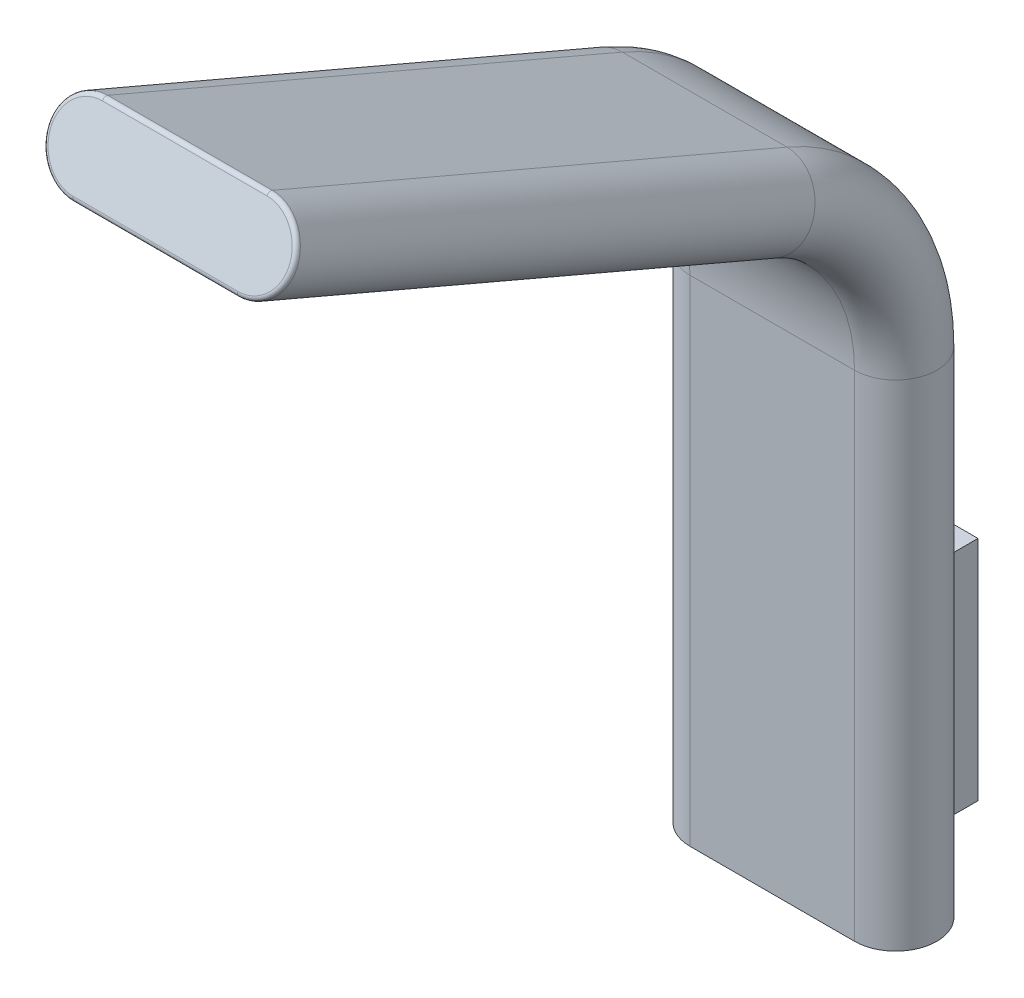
ISO-10303-21;
HEADER;
FILE_DESCRIPTION(('STEP AP214'),'2;1');
FILE_NAME('part.step','',(''),(''),'','','');
FILE_SCHEMA(('AUTOMOTIVE_DESIGN { 1 0 10303 214 1 1 1 1 }'));
ENDSEC;
DATA;
#1=APPLICATION_CONTEXT('core data for automotive mechanical design processes');
#2=APPLICATION_PROTOCOL_DEFINITION('international standard','automotive_design',2000,#1);
#3=PRODUCT_CONTEXT('',#1,'mechanical');
#4=PRODUCT('Part','Part','',(#3));
#5=PRODUCT_RELATED_PRODUCT_CATEGORY('part','',(#4));
#6=PRODUCT_DEFINITION_FORMATION('','',#4);
#7=PRODUCT_DEFINITION_CONTEXT('part definition',#1,'design');
#8=PRODUCT_DEFINITION('design','',#6,#7);
#9=PRODUCT_DEFINITION_SHAPE('','',#8);
#10=(LENGTH_UNIT() NAMED_UNIT(*) SI_UNIT(.MILLI.,.METRE.));
#11=(NAMED_UNIT(*) PLANE_ANGLE_UNIT() SI_UNIT($,.RADIAN.));
#12=(NAMED_UNIT(*) SI_UNIT($,.STERADIAN.) SOLID_ANGLE_UNIT());
#13=UNCERTAINTY_MEASURE_WITH_UNIT(LENGTH_MEASURE(1.E-05),#10,'distance_accuracy_value','');
#14=(GEOMETRIC_REPRESENTATION_CONTEXT(3) GLOBAL_UNCERTAINTY_ASSIGNED_CONTEXT((#13)) GLOBAL_UNIT_ASSIGNED_CONTEXT((#10,
#11,#12)) REPRESENTATION_CONTEXT('',''));
#15=CARTESIAN_POINT('',(0.,0.,0.));
#16=DIRECTION('',(0.,0.,1.));
#17=DIRECTION('',(1.,0.,0.));
#18=AXIS2_PLACEMENT_3D('',#15,#16,#17);
#19=CARTESIAN_POINT('',(-20.,0.,-10.));
#20=DIRECTION('',(0.,0.,-1.));
#21=DIRECTION('',(-1.,0.,0.));
#22=AXIS2_PLACEMENT_3D('',#19,#20,#21);
#23=PLANE('',#22);
#24=DIRECTION('',(0.,1.,0.));
#25=VECTOR('',#24,1.);
#26=CARTESIAN_POINT('',(20.,0.,-10.));
#27=LINE('',#26,#25);
#28=CARTESIAN_POINT('',(20.,69.7986493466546,-10.));
#29=VERTEX_POINT('',#28);
#30=CARTESIAN_POINT('',(20.,120.193335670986,-10.));
#31=VERTEX_POINT('',#30);
#32=EDGE_CURVE('E258',#29,#31,#27,.T.);
#33=ORIENTED_EDGE('',*,*,#32,.F.);
#34=DIRECTION('',(1.,0.,0.));
#35=VECTOR('',#34,1.);
#36=CARTESIAN_POINT('',(20.,69.7986493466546,-10.));
#37=LINE('',#36,#35);
#38=CARTESIAN_POINT('',(-20.,69.7986493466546,-10.));
#39=VERTEX_POINT('',#38);
#40=EDGE_CURVE('E217',#39,#29,#37,.T.);
#41=ORIENTED_EDGE('',*,*,#40,.F.);
#42=DIRECTION('',(0.,1.,0.));
#43=VECTOR('',#42,1.);
#44=CARTESIAN_POINT('',(-20.,0.,-10.));
#45=LINE('',#44,#43);
#46=CARTESIAN_POINT('',(-20.,120.193335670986,-10.));
#47=VERTEX_POINT('',#46);
#48=EDGE_CURVE('E248',#39,#47,#45,.T.);
#49=ORIENTED_EDGE('',*,*,#48,.T.);
#50=DIRECTION('',(-1.,0.,0.));
#51=VECTOR('',#50,1.);
#52=CARTESIAN_POINT('',(-20.,120.193335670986,-10.));
#53=LINE('',#52,#51);
#54=EDGE_CURVE('E244',#31,#47,#53,.T.);
#55=ORIENTED_EDGE('',*,*,#54,.F.);
#56=EDGE_LOOP('',(#33,#41,#49,#55));
#57=FACE_BOUND('',#56,.T.);
#58=ADVANCED_FACE('F39',(#57),#23,.T.);
#59=CARTESIAN_POINT('',(-20.,0.,-10.));
#60=VERTEX_POINT('',#59);
#61=CARTESIAN_POINT('',(-20.,14.5866743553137,-10.));
#62=VERTEX_POINT('',#61);
#63=EDGE_CURVE('E250',#60,#62,#45,.T.);
#64=ORIENTED_EDGE('',*,*,#63,.T.);
#65=DIRECTION('',(-1.,0.,0.));
#66=VECTOR('',#65,1.);
#67=CARTESIAN_POINT('',(20.,14.5866743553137,-10.));
#68=LINE('',#67,#66);
#69=CARTESIAN_POINT('',(20.,14.5866743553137,-10.));
#70=VERTEX_POINT('',#69);
#71=EDGE_CURVE('E204',#70,#62,#68,.T.);
#72=ORIENTED_EDGE('',*,*,#71,.F.);
#73=CARTESIAN_POINT('',(20.,0.,-10.));
#74=VERTEX_POINT('',#73);
#75=EDGE_CURVE('E249',#74,#70,#27,.T.);
#76=ORIENTED_EDGE('',*,*,#75,.F.);
#77=DIRECTION('',(-1.,0.,0.));
#78=VECTOR('',#77,1.);
#79=CARTESIAN_POINT('',(-20.,0.,-10.));
#80=LINE('',#79,#78);
#81=EDGE_CURVE('E239',#74,#60,#80,.T.);
#82=ORIENTED_EDGE('',*,*,#81,.T.);
#83=EDGE_LOOP('',(#64,#72,#76,#82));
#84=FACE_BOUND('',#83,.T.);
#85=ADVANCED_FACE('F397',(#84),#23,.T.);
#86=CARTESIAN_POINT('',(-20.,0.,0.));
#87=DIRECTION('',(0.,1.,0.));
#88=DIRECTION('',(0.,0.,1.));
#89=AXIS2_PLACEMENT_3D('',#86,#87,#88);
#90=PLANE('',#89);
#91=CARTESIAN_POINT('',(-20.,0.,0.));
#92=DIRECTION('',(0.,1.,0.));
#93=DIRECTION('',(0.,0.,1.));
#94=AXIS2_PLACEMENT_3D('',#91,#92,#93);
#95=CIRCLE('',#94,10.);
#96=CARTESIAN_POINT('',(-20.,0.,10.));
#97=VERTEX_POINT('',#96);
#98=EDGE_CURVE('E243',#60,#97,#95,.T.);
#99=ORIENTED_EDGE('',*,*,#98,.F.);
#100=ORIENTED_EDGE('',*,*,#81,.F.);
#101=CARTESIAN_POINT('',(20.,0.,0.));
#102=DIRECTION('',(0.,1.,0.));
#103=DIRECTION('',(0.,0.,-1.));
#104=AXIS2_PLACEMENT_3D('',#101,#102,#103);
#105=CIRCLE('',#104,9.99999999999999);
#106=CARTESIAN_POINT('',(20.,0.,9.99999999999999));
#107=VERTEX_POINT('',#106);
#108=EDGE_CURVE('E310',#107,#74,#105,.T.);
#109=ORIENTED_EDGE('',*,*,#108,.F.);
#110=DIRECTION('',(1.,0.,0.));
#111=VECTOR('',#110,1.);
#112=CARTESIAN_POINT('',(-20.,0.,10.));
#113=LINE('',#112,#111);
#114=EDGE_CURVE('E286',#97,#107,#113,.T.);
#115=ORIENTED_EDGE('',*,*,#114,.F.);
#116=EDGE_LOOP('',(#99,#100,#109,#115));
#117=FACE_BOUND('',#116,.T.);
#118=ADVANCED_FACE('F403',(#117),#90,.F.);
#119=CARTESIAN_POINT('',(-20.,220.,156.32654574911));
#120=DIRECTION('',(0.,0.392931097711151,0.919567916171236));
#121=DIRECTION('',(0.,-0.919567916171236,0.392931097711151));
#122=AXIS2_PLACEMENT_3D('',#119,#120,#121);
#123=PLANE('',#122);
#124=CARTESIAN_POINT('',(20.,220.,156.32654574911));
#125=DIRECTION('',(0.,0.392931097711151,0.919567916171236));
#126=DIRECTION('',(0.,-0.919567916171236,0.392931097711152));
#127=AXIS2_PLACEMENT_3D('',#124,#125,#126);
#128=CIRCLE('',#127,8.99999999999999);
#129=CARTESIAN_POINT('',(20.,211.723888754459,159.86292562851));
#130=VERTEX_POINT('',#129);
#131=CARTESIAN_POINT('',(20.,228.276111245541,152.79016586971));
#132=VERTEX_POINT('',#131);
#133=EDGE_CURVE('E343',#130,#132,#128,.T.);
#134=ORIENTED_EDGE('',*,*,#133,.T.);
#135=DIRECTION('',(-1.,0.,0.));
#136=VECTOR('',#135,1.);
#137=CARTESIAN_POINT('',(-20.,228.276111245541,152.79016586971));
#138=LINE('',#137,#136);
#139=CARTESIAN_POINT('',(-20.,228.276111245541,152.79016586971));
#140=VERTEX_POINT('',#139);
#141=EDGE_CURVE('E346',#132,#140,#138,.T.);
#142=ORIENTED_EDGE('',*,*,#141,.T.);
#143=CARTESIAN_POINT('',(-20.,220.,156.32654574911));
#144=DIRECTION('',(0.,0.392931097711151,0.919567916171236));
#145=DIRECTION('',(0.,-0.919567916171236,0.392931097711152));
#146=AXIS2_PLACEMENT_3D('',#143,#144,#145);
#147=CIRCLE('',#146,9.);
#148=CARTESIAN_POINT('',(-20.,211.723888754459,159.86292562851));
#149=VERTEX_POINT('',#148);
#150=EDGE_CURVE('E328',#140,#149,#147,.T.);
#151=ORIENTED_EDGE('',*,*,#150,.T.);
#152=DIRECTION('',(1.,0.,0.));
#153=VECTOR('',#152,1.);
#154=CARTESIAN_POINT('',(-20.,211.723888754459,159.86292562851));
#155=LINE('',#154,#153);
#156=EDGE_CURVE('E340',#149,#130,#155,.T.);
#157=ORIENTED_EDGE('',*,*,#156,.T.);
#158=EDGE_LOOP('',(#134,#142,#151,#157));
#159=FACE_BOUND('',#158,.T.);
#160=ADVANCED_FACE('F427',(#159),#123,.T.);
#161=CARTESIAN_POINT('',(-20.,0.,0.));
#162=DIRECTION('',(0.,1.,0.));
#163=DIRECTION('',(0.,0.,1.));
#164=AXIS2_PLACEMENT_3D('',#161,#162,#163);
#165=CYLINDRICAL_SURFACE('',#164,10.);
#166=DIRECTION('',(0.,1.,0.));
#167=VECTOR('',#166,1.);
#168=CARTESIAN_POINT('',(-20.,0.,10.));
#169=LINE('',#168,#167);
#170=CARTESIAN_POINT('',(-20.,120.193335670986,10.));
#171=VERTEX_POINT('',#170);
#172=EDGE_CURVE('E290',#97,#171,#169,.T.);
#173=ORIENTED_EDGE('',*,*,#172,.T.);
#174=CARTESIAN_POINT('',(-20.,120.193335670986,0.));
#175=DIRECTION('',(0.,1.,0.));
#176=DIRECTION('',(0.,0.,1.));
#177=AXIS2_PLACEMENT_3D('',#174,#175,#176);
#178=CIRCLE('',#177,10.);
#179=EDGE_CURVE('E254',#47,#171,#178,.T.);
#180=ORIENTED_EDGE('',*,*,#179,.F.);
#181=ORIENTED_EDGE('',*,*,#48,.F.);
#182=DIRECTION('',(0.,1.,0.));
#183=VECTOR('',#182,1.);
#184=CARTESIAN_POINT('',(-20.,14.5866743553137,-10.));
#185=LINE('',#184,#183);
#186=EDGE_CURVE('E198',#62,#39,#185,.T.);
#187=ORIENTED_EDGE('',*,*,#186,.F.);
#188=ORIENTED_EDGE('',*,*,#63,.F.);
#189=ORIENTED_EDGE('',*,*,#98,.T.);
#190=EDGE_LOOP('',(#173,#180,#181,#187,#188,#189));
#191=FACE_BOUND('',#190,.T.);
#192=ADVANCED_FACE('F423',(#191),#165,.T.);
#193=CARTESIAN_POINT('',(-20.,0.,10.));
#194=DIRECTION('',(0.,0.,1.));
#195=DIRECTION('',(1.,0.,0.));
#196=AXIS2_PLACEMENT_3D('',#193,#194,#195);
#197=PLANE('',#196);
#198=DIRECTION('',(0.,1.,0.));
#199=VECTOR('',#198,1.);
#200=CARTESIAN_POINT('',(20.,0.,9.99999999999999));
#201=LINE('',#200,#199);
#202=CARTESIAN_POINT('',(20.,120.193335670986,9.99999999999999));
#203=VERTEX_POINT('',#202);
#204=EDGE_CURVE('E314',#107,#203,#201,.T.);
#205=ORIENTED_EDGE('',*,*,#204,.T.);
#206=DIRECTION('',(1.,0.,0.));
#207=VECTOR('',#206,1.);
#208=CARTESIAN_POINT('',(-20.,120.193335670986,10.));
#209=LINE('',#208,#207);
#210=EDGE_CURVE('E294',#171,#203,#209,.T.);
#211=ORIENTED_EDGE('',*,*,#210,.F.);
#212=ORIENTED_EDGE('',*,*,#172,.F.);
#213=ORIENTED_EDGE('',*,*,#114,.T.);
#214=EDGE_LOOP('',(#205,#211,#212,#213));
#215=FACE_BOUND('',#214,.T.);
#216=ADVANCED_FACE('F426',(#215),#197,.T.);
#217=CARTESIAN_POINT('',(20.,0.,0.));
#218=DIRECTION('',(0.,1.,0.));
#219=DIRECTION('',(0.,0.,1.));
#220=AXIS2_PLACEMENT_3D('',#217,#218,#219);
#221=CYLINDRICAL_SURFACE('',#220,9.99999999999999);
#222=CARTESIAN_POINT('',(20.,120.193335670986,0.));
#223=DIRECTION('',(0.,1.,0.));
#224=DIRECTION('',(0.,0.,-1.));
#225=AXIS2_PLACEMENT_3D('',#222,#223,#224);
#226=CIRCLE('',#225,9.99999999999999);
#227=EDGE_CURVE('E272',#203,#31,#226,.T.);
#228=ORIENTED_EDGE('',*,*,#227,.F.);
#229=ORIENTED_EDGE('',*,*,#204,.F.);
#230=ORIENTED_EDGE('',*,*,#108,.T.);
#231=ORIENTED_EDGE('',*,*,#75,.T.);
#232=DIRECTION('',(0.,-1.,0.));
#233=VECTOR('',#232,1.);
#234=CARTESIAN_POINT('',(20.,14.5866743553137,-10.));
#235=LINE('',#234,#233);
#236=EDGE_CURVE('E221',#29,#70,#235,.T.);
#237=ORIENTED_EDGE('',*,*,#236,.F.);
#238=ORIENTED_EDGE('',*,*,#32,.T.);
#239=EDGE_LOOP('',(#228,#229,#230,#231,#237,#238));
#240=FACE_BOUND('',#239,.T.);
#241=ADVANCED_FACE('F415',(#240),#221,.T.);
#242=CARTESIAN_POINT('',(0.,120.193335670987,50.));
#243=DIRECTION('',(1.,0.,0.));
#244=DIRECTION('',(0.,0.,-1.));
#245=AXIS2_PLACEMENT_3D('',#242,#243,#244);
#246=CYLINDRICAL_SURFACE('',#245,60.);
#247=CARTESIAN_POINT('',(-20.,120.193335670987,50.));
#248=DIRECTION('',(1.,0.,0.));
#249=DIRECTION('',(0.,0.,-1.));
#250=AXIS2_PLACEMENT_3D('',#247,#248,#249);
#251=CIRCLE('',#250,60.);
#252=CARTESIAN_POINT('',(-20.,175.367410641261,26.4241341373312));
#253=VERTEX_POINT('',#252);
#254=EDGE_CURVE('E263',#47,#253,#251,.T.);
#255=ORIENTED_EDGE('',*,*,#254,.T.);
#256=DIRECTION('',(-1.,0.,0.));
#257=VECTOR('',#256,1.);
#258=CARTESIAN_POINT('',(-20.,175.367410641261,26.4241341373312));
#259=LINE('',#258,#257);
#260=CARTESIAN_POINT('',(20.,175.367410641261,26.4241341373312));
#261=VERTEX_POINT('',#260);
#262=EDGE_CURVE('E259',#261,#253,#259,.T.);
#263=ORIENTED_EDGE('',*,*,#262,.F.);
#264=CARTESIAN_POINT('',(20.,120.193335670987,50.));
#265=DIRECTION('',(1.,0.,0.));
#266=DIRECTION('',(0.,0.,-1.));
#267=AXIS2_PLACEMENT_3D('',#264,#265,#266);
#268=CIRCLE('',#267,60.);
#269=EDGE_CURVE('E264',#31,#261,#268,.T.);
#270=ORIENTED_EDGE('',*,*,#269,.F.);
#271=ORIENTED_EDGE('',*,*,#54,.T.);
#272=EDGE_LOOP('',(#255,#263,#270,#271));
#273=FACE_BOUND('',#272,.T.);
#274=ADVANCED_FACE('F411',(#273),#246,.T.);
#275=CARTESIAN_POINT('',(-20.,120.193335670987,50.));
#276=DIRECTION('',(1.,0.,0.));
#277=DIRECTION('',(0.,0.,-1.));
#278=AXIS2_PLACEMENT_3D('',#275,#276,#277);
#279=TOROIDAL_SURFACE('',#278,50.,10.);
#280=CARTESIAN_POINT('',(-20.,120.193335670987,50.));
#281=DIRECTION('',(1.,0.,0.));
#282=DIRECTION('',(0.,0.,-1.));
#283=AXIS2_PLACEMENT_3D('',#280,#281,#282);
#284=CIRCLE('',#283,40.);
#285=CARTESIAN_POINT('',(-20.,156.976052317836,34.2827560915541));
#286=VERTEX_POINT('',#285);
#287=EDGE_CURVE('E298',#171,#286,#284,.T.);
#288=ORIENTED_EDGE('',*,*,#287,.T.);
#289=CARTESIAN_POINT('',(-20.,166.171731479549,30.3534451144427));
#290=DIRECTION('',(0.,0.392931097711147,0.919567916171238));
#291=DIRECTION('',(0.,-0.919567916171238,0.392931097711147));
#292=AXIS2_PLACEMENT_3D('',#289,#290,#291);
#293=CIRCLE('',#292,10.);
#294=EDGE_CURVE('E268',#253,#286,#293,.T.);
#295=ORIENTED_EDGE('',*,*,#294,.F.);
#296=ORIENTED_EDGE('',*,*,#254,.F.);
#297=ORIENTED_EDGE('',*,*,#179,.T.);
#298=EDGE_LOOP('',(#288,#295,#296,#297));
#299=FACE_BOUND('',#298,.T.);
#300=ADVANCED_FACE('F414',(#299),#279,.T.);
#301=CARTESIAN_POINT('',(0.,120.193335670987,50.));
#302=DIRECTION('',(1.,0.,0.));
#303=DIRECTION('',(0.,0.,-1.));
#304=AXIS2_PLACEMENT_3D('',#301,#302,#303);
#305=CYLINDRICAL_SURFACE('',#304,40.);
#306=CARTESIAN_POINT('',(20.,120.193335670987,50.));
#307=DIRECTION('',(1.,0.,0.));
#308=DIRECTION('',(0.,0.,-1.));
#309=AXIS2_PLACEMENT_3D('',#306,#307,#308);
#310=CIRCLE('',#309,40.);
#311=CARTESIAN_POINT('',(20.,156.976052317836,34.2827560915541));
#312=VERTEX_POINT('',#311);
#313=EDGE_CURVE('E321',#203,#312,#310,.T.);
#314=ORIENTED_EDGE('',*,*,#313,.T.);
#315=DIRECTION('',(1.,0.,0.));
#316=VECTOR('',#315,1.);
#317=CARTESIAN_POINT('',(-20.,156.976052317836,34.2827560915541));
#318=LINE('',#317,#316);
#319=EDGE_CURVE('E302',#286,#312,#318,.T.);
#320=ORIENTED_EDGE('',*,*,#319,.F.);
#321=ORIENTED_EDGE('',*,*,#287,.F.);
#322=ORIENTED_EDGE('',*,*,#210,.T.);
#323=EDGE_LOOP('',(#314,#320,#321,#322));
#324=FACE_BOUND('',#323,.T.);
#325=ADVANCED_FACE('F431',(#324),#305,.F.);
#326=CARTESIAN_POINT('',(20.,120.193335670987,50.));
#327=DIRECTION('',(1.,0.,0.));
#328=DIRECTION('',(0.,0.,-1.));
#329=AXIS2_PLACEMENT_3D('',#326,#327,#328);
#330=TOROIDAL_SURFACE('',#329,50.,9.99999999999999);
#331=CARTESIAN_POINT('',(20.,166.171731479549,30.3534451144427));
#332=DIRECTION('',(0.,0.392931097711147,0.919567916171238));
#333=DIRECTION('',(0.,0.919567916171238,-0.392931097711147));
#334=AXIS2_PLACEMENT_3D('',#331,#332,#333);
#335=CIRCLE('',#334,9.99999999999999);
#336=EDGE_CURVE('E282',#312,#261,#335,.T.);
#337=ORIENTED_EDGE('',*,*,#336,.F.);
#338=ORIENTED_EDGE('',*,*,#313,.F.);
#339=ORIENTED_EDGE('',*,*,#227,.T.);
#340=ORIENTED_EDGE('',*,*,#269,.T.);
#341=EDGE_LOOP('',(#337,#338,#339,#340));
#342=FACE_BOUND('',#341,.T.);
#343=ADVANCED_FACE('F421',(#342),#330,.T.);
#344=CARTESIAN_POINT('',(-20.,175.367410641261,26.4241341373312));
#345=DIRECTION('',(0.,0.919567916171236,-0.392931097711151));
#346=DIRECTION('',(0.,0.392931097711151,0.919567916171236));
#347=AXIS2_PLACEMENT_3D('',#344,#345,#346);
#348=PLANE('',#347);
#349=DIRECTION('',(0.,0.392931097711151,0.919567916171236));
#350=VECTOR('',#349,1.);
#351=CARTESIAN_POINT('',(-20.,175.367410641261,26.4241341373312));
#352=LINE('',#351,#350);
#353=CARTESIAN_POINT('',(-20.,228.802748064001,151.477666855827));
#354=VERTEX_POINT('',#353);
#355=EDGE_CURVE('E273',#253,#354,#352,.T.);
#356=ORIENTED_EDGE('',*,*,#355,.T.);
#357=DIRECTION('',(-1.,0.,0.));
#358=VECTOR('',#357,1.);
#359=CARTESIAN_POINT('',(-20.,228.802748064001,151.477666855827));
#360=LINE('',#359,#358);
#361=CARTESIAN_POINT('',(20.,228.802748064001,151.477666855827));
#362=VERTEX_POINT('',#361);
#363=EDGE_CURVE('E350',#354,#362,#360,.F.);
#364=ORIENTED_EDGE('',*,*,#363,.T.);
#365=DIRECTION('',(0.,0.392931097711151,0.919567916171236));
#366=VECTOR('',#365,1.);
#367=CARTESIAN_POINT('',(20.,175.367410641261,26.4241341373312));
#368=LINE('',#367,#366);
#369=EDGE_CURVE('E278',#261,#362,#368,.T.);
#370=ORIENTED_EDGE('',*,*,#369,.F.);
#371=ORIENTED_EDGE('',*,*,#262,.T.);
#372=EDGE_LOOP('',(#356,#364,#370,#371));
#373=FACE_BOUND('',#372,.T.);
#374=ADVANCED_FACE('F417',(#373),#348,.T.);
#375=CARTESIAN_POINT('',(-20.,166.171731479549,30.3534451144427));
#376=DIRECTION('',(0.,0.392931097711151,0.919567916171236));
#377=DIRECTION('',(0.,-0.919567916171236,0.392931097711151));
#378=AXIS2_PLACEMENT_3D('',#375,#376,#377);
#379=CYLINDRICAL_SURFACE('',#378,10.);
#380=DIRECTION('',(0.,0.392931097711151,0.919567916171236));
#381=VECTOR('',#380,1.);
#382=CARTESIAN_POINT('',(-20.,156.976052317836,34.2827560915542));
#383=LINE('',#382,#381);
#384=CARTESIAN_POINT('',(-20.,210.411389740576,159.33628881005));
#385=VERTEX_POINT('',#384);
#386=EDGE_CURVE('E277',#286,#385,#383,.T.);
#387=ORIENTED_EDGE('',*,*,#386,.T.);
#388=CARTESIAN_POINT('',(-20.,219.607068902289,155.406977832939));
#389=DIRECTION('',(0.,0.392931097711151,0.919567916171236));
#390=DIRECTION('',(0.,-0.919567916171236,0.392931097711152));
#391=AXIS2_PLACEMENT_3D('',#388,#389,#390);
#392=CIRCLE('',#391,10.);
#393=EDGE_CURVE('E360',#385,#354,#392,.F.);
#394=ORIENTED_EDGE('',*,*,#393,.T.);
#395=ORIENTED_EDGE('',*,*,#355,.F.);
#396=ORIENTED_EDGE('',*,*,#294,.T.);
#397=EDGE_LOOP('',(#387,#394,#395,#396));
#398=FACE_BOUND('',#397,.T.);
#399=ADVANCED_FACE('F420',(#398),#379,.T.);
#400=CARTESIAN_POINT('',(-20.,156.976052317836,34.2827560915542));
#401=DIRECTION('',(0.,-0.919567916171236,0.392931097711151));
#402=DIRECTION('',(0.,-0.392931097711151,-0.919567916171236));
#403=AXIS2_PLACEMENT_3D('',#400,#401,#402);
#404=PLANE('',#403);
#405=CARTESIAN_POINT('',(0.,197.642774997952,129.454183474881));
#406=DIRECTION('',(0.,-0.919567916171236,0.392931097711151));
#407=DIRECTION('',(0.,-0.392931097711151,-0.919567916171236));
#408=AXIS2_PLACEMENT_3D('',#405,#406,#407);
#409=CIRCLE('',#408,11.);
#410=CARTESIAN_POINT('',(-11.0000000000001,197.642774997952,129.454183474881));
#411=VERTEX_POINT('',#410);
#412=CARTESIAN_POINT('',(11.,197.642774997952,129.454183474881));
#413=VERTEX_POINT('',#412);
#414=EDGE_CURVE('E49',#411,#413,#409,.F.);
#415=ORIENTED_EDGE('',*,*,#414,.T.);
#416=DIRECTION('',(0.,0.392931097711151,0.919567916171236));
#417=VECTOR('',#416,1.);
#418=CARTESIAN_POINT('',(11.,168.172942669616,60.4865897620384));
#419=LINE('',#418,#417);
#420=CARTESIAN_POINT('',(11.,168.172942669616,60.4865897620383));
#421=VERTEX_POINT('',#420);
#422=EDGE_CURVE('E11',#413,#421,#419,.F.);
#423=ORIENTED_EDGE('',*,*,#422,.T.);
#424=CARTESIAN_POINT('',(0.,168.172942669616,60.4865897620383));
#425=DIRECTION('',(0.,-0.919567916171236,0.392931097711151));
#426=DIRECTION('',(0.,-0.392931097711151,-0.919567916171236));
#427=AXIS2_PLACEMENT_3D('',#424,#425,#426);
#428=CIRCLE('',#427,11.);
#429=CARTESIAN_POINT('',(-11.0000000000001,168.172942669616,60.4865897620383));
#430=VERTEX_POINT('',#429);
#431=EDGE_CURVE('E181',#421,#430,#428,.F.);
#432=ORIENTED_EDGE('',*,*,#431,.T.);
#433=DIRECTION('',(0.,-0.392931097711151,-0.919567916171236));
#434=VECTOR('',#433,1.);
#435=CARTESIAN_POINT('',(-11.0000000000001,197.642774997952,129.454183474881));
#436=LINE('',#435,#434);
#437=EDGE_CURVE('E60',#430,#411,#436,.F.);
#438=ORIENTED_EDGE('',*,*,#437,.T.);
#439=EDGE_LOOP('',(#415,#423,#432,#438));
#440=FACE_BOUND('',#439,.T.);
#441=DIRECTION('',(0.,0.392931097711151,0.919567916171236));
#442=VECTOR('',#441,1.);
#443=CARTESIAN_POINT('',(20.,156.976052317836,34.2827560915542));
#444=LINE('',#443,#442);
#445=CARTESIAN_POINT('',(20.,210.411389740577,159.33628881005));
#446=VERTEX_POINT('',#445);
#447=EDGE_CURVE('E306',#312,#446,#444,.T.);
#448=ORIENTED_EDGE('',*,*,#447,.T.);
#449=DIRECTION('',(1.,0.,0.));
#450=VECTOR('',#449,1.);
#451=CARTESIAN_POINT('',(-20.,210.411389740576,159.33628881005));
#452=LINE('',#451,#450);
#453=EDGE_CURVE('E357',#446,#385,#452,.F.);
#454=ORIENTED_EDGE('',*,*,#453,.T.);
#455=ORIENTED_EDGE('',*,*,#386,.F.);
#456=ORIENTED_EDGE('',*,*,#319,.T.);
#457=EDGE_LOOP('',(#448,#454,#455,#456));
#458=FACE_BOUND('',#457,.T.);
#459=ADVANCED_FACE('F435',(#440,#458),#404,.T.);
#460=CARTESIAN_POINT('',(20.,166.171731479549,30.3534451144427));
#461=DIRECTION('',(0.,0.392931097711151,0.919567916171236));
#462=DIRECTION('',(0.,-0.919567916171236,0.392931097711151));
#463=AXIS2_PLACEMENT_3D('',#460,#461,#462);
#464=CYLINDRICAL_SURFACE('',#463,9.99999999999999);
#465=ORIENTED_EDGE('',*,*,#369,.T.);
#466=CARTESIAN_POINT('',(20.,219.607068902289,155.406977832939));
#467=DIRECTION('',(0.,0.392931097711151,0.919567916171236));
#468=DIRECTION('',(0.,-0.919567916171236,0.392931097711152));
#469=AXIS2_PLACEMENT_3D('',#466,#467,#468);
#470=CIRCLE('',#469,9.99999999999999);
#471=EDGE_CURVE('E354',#362,#446,#470,.F.);
#472=ORIENTED_EDGE('',*,*,#471,.T.);
#473=ORIENTED_EDGE('',*,*,#447,.F.);
#474=ORIENTED_EDGE('',*,*,#336,.T.);
#475=EDGE_LOOP('',(#465,#472,#473,#474));
#476=FACE_BOUND('',#475,.T.);
#477=ADVANCED_FACE('F405',(#476),#464,.T.);
#478=CARTESIAN_POINT('',(-20.,14.5866743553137,-20.));
#479=DIRECTION('',(1.,0.,0.));
#480=DIRECTION('',(0.,0.,-1.));
#481=AXIS2_PLACEMENT_3D('',#478,#479,#480);
#482=PLANE('',#481);
#483=ORIENTED_EDGE('',*,*,#186,.T.);
#484=DIRECTION('',(0.,0.,1.));
#485=VECTOR('',#484,1.);
#486=CARTESIAN_POINT('',(-20.,69.7986493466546,-20.));
#487=LINE('',#486,#485);
#488=CARTESIAN_POINT('',(-20.,69.7986493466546,-20.));
#489=VERTEX_POINT('',#488);
#490=EDGE_CURVE('E236',#489,#39,#487,.T.);
#491=ORIENTED_EDGE('',*,*,#490,.F.);
#492=DIRECTION('',(0.,1.,0.));
#493=VECTOR('',#492,1.);
#494=CARTESIAN_POINT('',(-20.,14.5866743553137,-20.));
#495=LINE('',#494,#493);
#496=CARTESIAN_POINT('',(-20.,14.5866743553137,-20.));
#497=VERTEX_POINT('',#496);
#498=EDGE_CURVE('E199',#497,#489,#495,.T.);
#499=ORIENTED_EDGE('',*,*,#498,.F.);
#500=DIRECTION('',(0.,0.,1.));
#501=VECTOR('',#500,1.);
#502=CARTESIAN_POINT('',(-20.,14.5866743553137,-20.));
#503=LINE('',#502,#501);
#504=EDGE_CURVE('E213',#497,#62,#503,.T.);
#505=ORIENTED_EDGE('',*,*,#504,.T.);
#506=EDGE_LOOP('',(#483,#491,#499,#505));
#507=FACE_BOUND('',#506,.T.);
#508=ADVANCED_FACE('F409',(#507),#482,.F.);
#509=CARTESIAN_POINT('',(20.,69.7986493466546,-20.));
#510=DIRECTION('',(0.,-1.,0.));
#511=DIRECTION('',(0.,0.,-1.));
#512=AXIS2_PLACEMENT_3D('',#509,#510,#511);
#513=PLANE('',#512);
#514=ORIENTED_EDGE('',*,*,#40,.T.);
#515=DIRECTION('',(0.,0.,1.));
#516=VECTOR('',#515,1.);
#517=CARTESIAN_POINT('',(20.,69.7986493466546,-20.));
#518=LINE('',#517,#516);
#519=CARTESIAN_POINT('',(20.,69.7986493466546,-20.));
#520=VERTEX_POINT('',#519);
#521=EDGE_CURVE('E233',#520,#29,#518,.T.);
#522=ORIENTED_EDGE('',*,*,#521,.F.);
#523=DIRECTION('',(1.,0.,0.));
#524=VECTOR('',#523,1.);
#525=CARTESIAN_POINT('',(20.,69.7986493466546,-20.));
#526=LINE('',#525,#524);
#527=EDGE_CURVE('E203',#489,#520,#526,.T.);
#528=ORIENTED_EDGE('',*,*,#527,.F.);
#529=ORIENTED_EDGE('',*,*,#490,.T.);
#530=EDGE_LOOP('',(#514,#522,#528,#529));
#531=FACE_BOUND('',#530,.T.);
#532=ADVANCED_FACE('F528',(#531),#513,.F.);
#533=CARTESIAN_POINT('',(20.,14.5866743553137,-20.));
#534=DIRECTION('',(-1.,0.,0.));
#535=DIRECTION('',(0.,0.,1.));
#536=AXIS2_PLACEMENT_3D('',#533,#534,#535);
#537=PLANE('',#536);
#538=ORIENTED_EDGE('',*,*,#236,.T.);
#539=DIRECTION('',(0.,0.,1.));
#540=VECTOR('',#539,1.);
#541=CARTESIAN_POINT('',(20.,14.5866743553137,-20.));
#542=LINE('',#541,#540);
#543=CARTESIAN_POINT('',(20.,14.5866743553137,-20.));
#544=VERTEX_POINT('',#543);
#545=EDGE_CURVE('E229',#544,#70,#542,.T.);
#546=ORIENTED_EDGE('',*,*,#545,.F.);
#547=DIRECTION('',(0.,-1.,0.));
#548=VECTOR('',#547,1.);
#549=CARTESIAN_POINT('',(20.,14.5866743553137,-20.));
#550=LINE('',#549,#548);
#551=EDGE_CURVE('E207',#520,#544,#550,.T.);
#552=ORIENTED_EDGE('',*,*,#551,.F.);
#553=ORIENTED_EDGE('',*,*,#521,.T.);
#554=EDGE_LOOP('',(#538,#546,#552,#553));
#555=FACE_BOUND('',#554,.T.);
#556=ADVANCED_FACE('F514',(#555),#537,.F.);
#557=CARTESIAN_POINT('',(20.,14.5866743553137,-20.));
#558=DIRECTION('',(0.,1.,0.));
#559=DIRECTION('',(0.,0.,1.));
#560=AXIS2_PLACEMENT_3D('',#557,#558,#559);
#561=PLANE('',#560);
#562=ORIENTED_EDGE('',*,*,#71,.T.);
#563=ORIENTED_EDGE('',*,*,#504,.F.);
#564=DIRECTION('',(-1.,0.,0.));
#565=VECTOR('',#564,1.);
#566=CARTESIAN_POINT('',(20.,14.5866743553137,-20.));
#567=LINE('',#566,#565);
#568=EDGE_CURVE('E210',#544,#497,#567,.T.);
#569=ORIENTED_EDGE('',*,*,#568,.F.);
#570=ORIENTED_EDGE('',*,*,#545,.T.);
#571=EDGE_LOOP('',(#562,#563,#569,#570));
#572=FACE_BOUND('',#571,.T.);
#573=ADVANCED_FACE('F520',(#572),#561,.F.);
#574=CARTESIAN_POINT('',(0.,0.,-20.));
#575=DIRECTION('',(0.,0.,1.));
#576=DIRECTION('',(1.,0.,0.));
#577=AXIS2_PLACEMENT_3D('',#574,#575,#576);
#578=PLANE('',#577);
#579=ORIENTED_EDGE('',*,*,#498,.T.);
#580=ORIENTED_EDGE('',*,*,#527,.T.);
#581=ORIENTED_EDGE('',*,*,#551,.T.);
#582=ORIENTED_EDGE('',*,*,#568,.T.);
#583=EDGE_LOOP('',(#579,#580,#581,#582));
#584=FACE_BOUND('',#583,.T.);
#585=ADVANCED_FACE('F478',(#584),#578,.F.);
#586=CARTESIAN_POINT('',(0.,169.092510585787,60.0936586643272));
#587=DIRECTION('',(0.,0.919567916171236,-0.392931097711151));
#588=DIRECTION('',(0.,0.392931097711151,0.919567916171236));
#589=AXIS2_PLACEMENT_3D('',#586,#587,#588);
#590=PLANE('',#589);
#591=CARTESIAN_POINT('',(0.,169.092510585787,60.0936586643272));
#592=DIRECTION('',(0.,-0.919567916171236,0.392931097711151));
#593=DIRECTION('',(0.,0.392931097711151,0.919567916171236));
#594=AXIS2_PLACEMENT_3D('',#591,#592,#593);
#595=CIRCLE('',#594,10.);
#596=CARTESIAN_POINT('',(-10.0000000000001,169.092510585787,60.0936586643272));
#597=VERTEX_POINT('',#596);
#598=CARTESIAN_POINT('',(9.99999999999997,169.092510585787,60.0936586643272));
#599=VERTEX_POINT('',#598);
#600=EDGE_CURVE('E165',#597,#599,#595,.T.);
#601=ORIENTED_EDGE('',*,*,#600,.T.);
#602=DIRECTION('',(0.,0.392931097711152,0.919567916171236));
#603=VECTOR('',#602,1.);
#604=CARTESIAN_POINT('',(9.99999999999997,169.092510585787,60.0936586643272));
#605=LINE('',#604,#603);
#606=CARTESIAN_POINT('',(9.99999999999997,198.562342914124,129.06125237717));
#607=VERTEX_POINT('',#606);
#608=EDGE_CURVE('E169',#599,#607,#605,.T.);
#609=ORIENTED_EDGE('',*,*,#608,.T.);
#610=CARTESIAN_POINT('',(0.,198.562342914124,129.06125237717));
#611=DIRECTION('',(0.,-0.919567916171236,0.392931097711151));
#612=DIRECTION('',(0.,-0.392931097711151,-0.919567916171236));
#613=AXIS2_PLACEMENT_3D('',#610,#611,#612);
#614=CIRCLE('',#613,10.);
#615=CARTESIAN_POINT('',(-10.0000000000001,198.562342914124,129.06125237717));
#616=VERTEX_POINT('',#615);
#617=EDGE_CURVE('E191',#607,#616,#614,.T.);
#618=ORIENTED_EDGE('',*,*,#617,.T.);
#619=DIRECTION('',(0.,-0.392931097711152,-0.919567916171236));
#620=VECTOR('',#619,1.);
#621=CARTESIAN_POINT('',(-10.0000000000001,169.092510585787,60.0936586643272));
#622=LINE('',#621,#620);
#623=EDGE_CURVE('E171',#616,#597,#622,.T.);
#624=ORIENTED_EDGE('',*,*,#623,.T.);
#625=EDGE_LOOP('',(#601,#609,#618,#624));
#626=FACE_BOUND('',#625,.T.);
#627=ADVANCED_FACE('F167',(#626),#590,.F.);
#628=CARTESIAN_POINT('',(-20.,211.330957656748,158.943357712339));
#629=DIRECTION('',(1.,0.,0.));
#630=DIRECTION('',(0.,1.,0.));
#631=AXIS2_PLACEMENT_3D('',#628,#629,#630);
#632=CYLINDRICAL_SURFACE('',#631,1.);
#633=CARTESIAN_POINT('',(-20.,211.330957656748,158.943357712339));
#634=DIRECTION('',(-1.,0.,0.));
#635=DIRECTION('',(0.,0.,1.));
#636=AXIS2_PLACEMENT_3D('',#633,#634,#635);
#637=CIRCLE('',#636,1.);
#638=EDGE_CURVE('E369',#385,#149,#637,.T.);
#639=ORIENTED_EDGE('',*,*,#638,.F.);
#640=ORIENTED_EDGE('',*,*,#453,.F.);
#641=CARTESIAN_POINT('',(20.,211.330957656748,158.943357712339));
#642=DIRECTION('',(1.,0.,0.));
#643=DIRECTION('',(0.,0.,-1.));
#644=AXIS2_PLACEMENT_3D('',#641,#642,#643);
#645=CIRCLE('',#644,1.);
#646=EDGE_CURVE('E176',#130,#446,#645,.T.);
#647=ORIENTED_EDGE('',*,*,#646,.F.);
#648=ORIENTED_EDGE('',*,*,#156,.F.);
#649=EDGE_LOOP('',(#639,#640,#647,#648));
#650=FACE_BOUND('',#649,.T.);
#651=ADVANCED_FACE('F471',(#650),#632,.T.);
#652=CARTESIAN_POINT('',(20.,219.607068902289,155.406977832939));
#653=DIRECTION('',(0.,0.392931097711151,0.919567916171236));
#654=DIRECTION('',(0.,-0.919567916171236,0.392931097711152));
#655=AXIS2_PLACEMENT_3D('',#652,#653,#654);
#656=TOROIDAL_SURFACE('',#655,8.99999999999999,1.);
#657=ORIENTED_EDGE('',*,*,#646,.T.);
#658=ORIENTED_EDGE('',*,*,#471,.F.);
#659=CARTESIAN_POINT('',(20.,227.88318014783,151.870597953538));
#660=DIRECTION('',(-1.,0.,0.));
#661=DIRECTION('',(0.,0.,1.));
#662=AXIS2_PLACEMENT_3D('',#659,#660,#661);
#663=CIRCLE('',#662,1.);
#664=EDGE_CURVE('E366',#132,#362,#663,.T.);
#665=ORIENTED_EDGE('',*,*,#664,.F.);
#666=ORIENTED_EDGE('',*,*,#133,.F.);
#667=EDGE_LOOP('',(#657,#658,#665,#666));
#668=FACE_BOUND('',#667,.T.);
#669=ADVANCED_FACE('F467',(#668),#656,.T.);
#670=CARTESIAN_POINT('',(-20.,219.607068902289,155.406977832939));
#671=DIRECTION('',(0.,0.392931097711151,0.919567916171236));
#672=DIRECTION('',(0.,-0.919567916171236,0.392931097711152));
#673=AXIS2_PLACEMENT_3D('',#670,#671,#672);
#674=TOROIDAL_SURFACE('',#673,9.,1.);
#675=ORIENTED_EDGE('',*,*,#638,.T.);
#676=ORIENTED_EDGE('',*,*,#150,.F.);
#677=CARTESIAN_POINT('',(-20.,227.88318014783,151.870597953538));
#678=DIRECTION('',(1.,0.,0.));
#679=DIRECTION('',(0.,0.,-1.));
#680=AXIS2_PLACEMENT_3D('',#677,#678,#679);
#681=CIRCLE('',#680,1.);
#682=EDGE_CURVE('E363',#354,#140,#681,.T.);
#683=ORIENTED_EDGE('',*,*,#682,.F.);
#684=ORIENTED_EDGE('',*,*,#393,.F.);
#685=EDGE_LOOP('',(#675,#676,#683,#684));
#686=FACE_BOUND('',#685,.T.);
#687=ADVANCED_FACE('F463',(#686),#674,.T.);
#688=CARTESIAN_POINT('',(-20.,227.88318014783,151.870597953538));
#689=DIRECTION('',(-1.,0.,0.));
#690=DIRECTION('',(0.,0.,1.));
#691=AXIS2_PLACEMENT_3D('',#688,#689,#690);
#692=CYLINDRICAL_SURFACE('',#691,1.);
#693=ORIENTED_EDGE('',*,*,#664,.T.);
#694=ORIENTED_EDGE('',*,*,#363,.F.);
#695=ORIENTED_EDGE('',*,*,#682,.T.);
#696=ORIENTED_EDGE('',*,*,#141,.F.);
#697=EDGE_LOOP('',(#693,#694,#695,#696));
#698=FACE_BOUND('',#697,.T.);
#699=ADVANCED_FACE('F460',(#698),#692,.T.);
#700=CARTESIAN_POINT('',(-11.0000000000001,169.092510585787,60.0936586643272));
#701=DIRECTION('',(0.,0.392931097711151,0.919567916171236));
#702=DIRECTION('',(0.,-0.919567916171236,0.392931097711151));
#703=AXIS2_PLACEMENT_3D('',#700,#701,#702);
#704=CYLINDRICAL_SURFACE('',#703,1.);
#705=CARTESIAN_POINT('',(-11.0000000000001,198.562342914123,129.06125237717));
#706=DIRECTION('',(0.,0.392931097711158,0.919567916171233));
#707=DIRECTION('',(0.,-0.919567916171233,0.392931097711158));
#708=AXIS2_PLACEMENT_3D('',#705,#706,#707);
#709=CIRCLE('',#708,1.);
#710=EDGE_CURVE('E184',#411,#616,#709,.T.);
#711=ORIENTED_EDGE('',*,*,#710,.F.);
#712=ORIENTED_EDGE('',*,*,#437,.F.);
#713=CARTESIAN_POINT('',(-11.0000000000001,169.092510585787,60.0936586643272));
#714=DIRECTION('',(0.,-0.392931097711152,-0.919567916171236));
#715=DIRECTION('',(0.,0.919567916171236,-0.392931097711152));
#716=AXIS2_PLACEMENT_3D('',#713,#714,#715);
#717=CIRCLE('',#716,1.);
#718=EDGE_CURVE('E43',#597,#430,#717,.T.);
#719=ORIENTED_EDGE('',*,*,#718,.F.);
#720=ORIENTED_EDGE('',*,*,#623,.F.);
#721=EDGE_LOOP('',(#711,#712,#719,#720));
#722=FACE_BOUND('',#721,.T.);
#723=ADVANCED_FACE('F41',(#722),#704,.T.);
#724=CARTESIAN_POINT('',(0.,169.092510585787,60.0936586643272));
#725=DIRECTION('',(0.,-0.919567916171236,0.392931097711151));
#726=DIRECTION('',(0.,-0.392931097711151,-0.919567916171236));
#727=AXIS2_PLACEMENT_3D('',#724,#725,#726);
#728=TOROIDAL_SURFACE('',#727,11.,1.);
#729=ORIENTED_EDGE('',*,*,#718,.T.);
#730=ORIENTED_EDGE('',*,*,#431,.F.);
#731=CARTESIAN_POINT('',(11.,169.092510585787,60.0936586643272));
#732=DIRECTION('',(0.,0.392931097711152,0.919567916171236));
#733=DIRECTION('',(0.,-0.919567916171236,0.392931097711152));
#734=AXIS2_PLACEMENT_3D('',#731,#732,#733);
#735=CIRCLE('',#734,1.);
#736=EDGE_CURVE('E179',#599,#421,#735,.T.);
#737=ORIENTED_EDGE('',*,*,#736,.F.);
#738=ORIENTED_EDGE('',*,*,#600,.F.);
#739=EDGE_LOOP('',(#729,#730,#737,#738));
#740=FACE_BOUND('',#739,.T.);
#741=ADVANCED_FACE('F180',(#740),#728,.T.);
#742=CARTESIAN_POINT('',(0.,198.562342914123,129.06125237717));
#743=DIRECTION('',(0.,-0.919567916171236,0.392931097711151));
#744=DIRECTION('',(0.,-0.392931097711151,-0.919567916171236));
#745=AXIS2_PLACEMENT_3D('',#742,#743,#744);
#746=TOROIDAL_SURFACE('',#745,11.,1.);
#747=ORIENTED_EDGE('',*,*,#710,.T.);
#748=ORIENTED_EDGE('',*,*,#617,.F.);
#749=CARTESIAN_POINT('',(11.,198.562342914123,129.06125237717));
#750=DIRECTION('',(0.,-0.392931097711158,-0.919567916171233));
#751=DIRECTION('',(0.,0.919567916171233,-0.392931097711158));
#752=AXIS2_PLACEMENT_3D('',#749,#750,#751);
#753=CIRCLE('',#752,1.);
#754=EDGE_CURVE('E185',#413,#607,#753,.T.);
#755=ORIENTED_EDGE('',*,*,#754,.F.);
#756=ORIENTED_EDGE('',*,*,#414,.F.);
#757=EDGE_LOOP('',(#747,#748,#755,#756));
#758=FACE_BOUND('',#757,.T.);
#759=ADVANCED_FACE('F388',(#758),#746,.T.);
#760=CARTESIAN_POINT('',(11.,169.092510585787,60.0936586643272));
#761=DIRECTION('',(0.,-0.392931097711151,-0.919567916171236));
#762=DIRECTION('',(0.,0.919567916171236,-0.392931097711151));
#763=AXIS2_PLACEMENT_3D('',#760,#761,#762);
#764=CYLINDRICAL_SURFACE('',#763,1.);
#765=ORIENTED_EDGE('',*,*,#736,.T.);
#766=ORIENTED_EDGE('',*,*,#422,.F.);
#767=ORIENTED_EDGE('',*,*,#754,.T.);
#768=ORIENTED_EDGE('',*,*,#608,.F.);
#769=EDGE_LOOP('',(#765,#766,#767,#768));
#770=FACE_BOUND('',#769,.T.);
#771=ADVANCED_FACE('F187',(#770),#764,.T.);
#772=CLOSED_SHELL('',(#58,#85,#118,#160,#192,#216,#241,#274,#300,#325,#343,#374,#399,#459,#477,
#508,#532,#556,#573,#585,#627,#651,#669,#687,#699,#723,#741,#759,#771));
#773=MANIFOLD_SOLID_BREP('B2',#772);
#774=ADVANCED_BREP_SHAPE_REPRESENTATION('',(#18,#773),#14);
#775=SHAPE_DEFINITION_REPRESENTATION(#9,#774);
ENDSEC;
END-ISO-10303-21;
